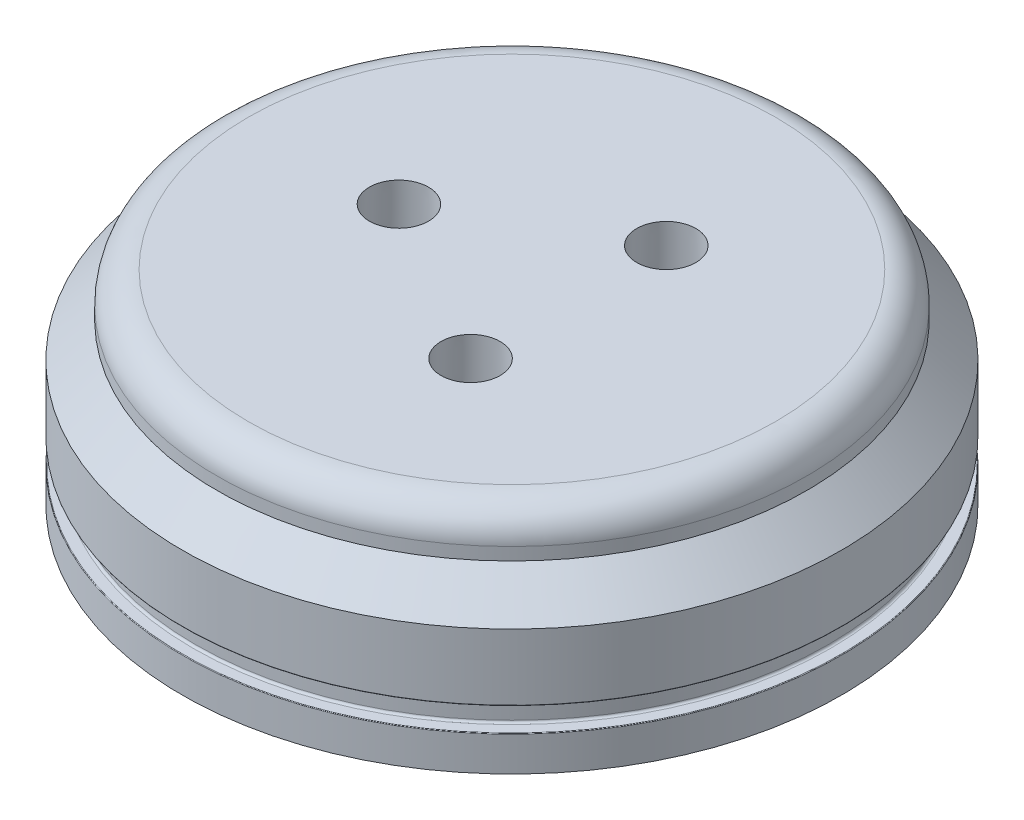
from build123d import *

# Parameters (mm, degrees)
CIRPATTERN1_COUNT              = 3
FILLET1_R                      = 6.35
F_8_32_TAPPED_HOLE1_AT_2_COUNT = 2
F_8_32_TAPPED_HOLE1_AT_2_PITCH = 12.7
CIRPATTERN3_COUNT              = 5


with BuildPart() as part:
    # Sketch1 → Revolve1 (revolve)
    with BuildSketch(Plane.XY, mode=Mode.PRIVATE) as revolve1_sk:
        with BuildLine():
            Line((-66.675, 0), (-66.675, 6.985))
            ThreePointArc((-66.675, 6.985), (-66.637802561, 7.074802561), (-66.548, 7.112))
            Line((-66.548, 7.112), (-64.4779, 7.112))
            ThreePointArc((-64.4779, 7.112), (-64.163591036, 7.242191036), (-64.0334, 7.5565))
            Line((-64.0334, 7.5565), (-64.0334, 11.4935))
            ThreePointArc((-64.0334, 11.4935), (-64.163591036, 11.807808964), (-64.4779, 11.938))
            Line((-64.4779, 11.938), (-66.548, 11.938))
            ThreePointArc((-66.548, 11.938), (-66.637802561, 11.975197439), (-66.675, 12.065))
            Line((-66.675, 12.065), (-66.675, 25.4))
            Line((-66.675, 25.4), (-59.69, 32.385))
            Line((-59.69, 32.385), (-59.69, 41.275))
            Line((-59.69, 41.275), (0, 41.275))
            Line((0, 41.275), (0, 32.385))
            Line((0, 32.385), (-50.8, 32.385))
            Line((-50.8, 32.385), (-50.8, 0))
            Line((-50.8, 0), (-66.675, 0))
        make_face()
    revolve(revolve1_sk.sketch.rotate(Axis((0, 0, 0), (0, 1, 0)), 270), axis=Axis((0, 0, 0), (0, 1, 0)))

    # Sketch2 → 1_4 NPT Tapped Hole1 (revolve, cut)
    with BuildSketch(Plane(origin=(-22.86, 32.385, 0), x_dir=(0, 0, -1), z_dir=(1, 0, 0))):
        Polygon((0, 0), (0, 8.89), (5.5626, 8.89), (5.5626, 10.033), (5.943680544, 10.033), (6.244082, 0), align=None)
    f_1_4_npt_tapped_hole1 = revolve(axis=Axis((-22.86, 26.035, 0), (0, 1, 0)), mode=Mode.SUBTRACT)

    # CirPattern1: 1_4 NPT Tapped Hole1 ×3 about axis
    cirpattern1_axis = Axis((0, 0, 0), (0, 1, 0))
    for i in range(1, CIRPATTERN1_COUNT):
        add(f_1_4_npt_tapped_hole1.rotate(cirpattern1_axis, i * 360 / CIRPATTERN1_COUNT), mode=Mode.SUBTRACT)

    # Fillet1
    fillet1_edges = [part.edges().sort_by_distance(p)[0] for p in [
        (0, 32.385, 50.8),
        (0, 41.275, 59.69),
    ]]
    fillet(fillet1_edges, radius=FILLET1_R)

    # Sketch10 → 8-32 Tapped Hole1 (revolve, cut)
    with BuildSketch(Plane(origin=(53.144542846, 0, 25.015024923), x_dir=(0, 0, -1), z_dir=(1, 0, 0))):
        Polygon((0, 0), (0, 13.331406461), (1.7272, 12.2936), (1.7272, 0), align=None)
    f_8_32_tapped_hole1 = revolve(axis=Axis((53.144542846, -6.35, 25.015024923), (0, 1, 0)), mode=Mode.SUBTRACT)

    # 8-32 Tapped Hole1 at 2: 8-32 Tapped Hole1 ×2
    with Locations(*[Vector(0.325568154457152, 0, -0.9455185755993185) * (i * F_8_32_TAPPED_HOLE1_AT_2_PITCH) for i in range(1, F_8_32_TAPPED_HOLE1_AT_2_COUNT)]):
        add(f_8_32_tapped_hole1, mode=Mode.SUBTRACT)

    # CirPattern3: 8-32 Tapped Hole1 ×5 about axis
    cirpattern3_axis = Axis((0, 0, 0), (0, 1, 0))
    for i in range(1, CIRPATTERN3_COUNT):
        add(f_8_32_tapped_hole1.rotate(cirpattern3_axis, i * 360 / CIRPATTERN3_COUNT), mode=Mode.SUBTRACT)

    # CirPattern3 copy 1 sketch → CirPattern3 copy 1 (revolve, cut)
    with BuildSketch(Plane(origin=(30.070598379, 0, -50.456446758), x_dir=(-0.9510565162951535, 0, -0.30901699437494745), z_dir=(0.30901699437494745, 0, -0.9510565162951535))):
        Polygon((0, 0), (0, 13.331406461), (1.7272, 12.2936), (1.7272, 0), align=None)
    revolve(axis=Axis((30.070598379, -6.35, -50.456446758), (0, 1, 0)), mode=Mode.SUBTRACT)

    # CirPattern3 copy 2 sketch → CirPattern3 copy 2 (revolve, cut)
    with BuildSketch(Plane(origin=(-38.694606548, 0, -44.190738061), x_dir=(-0.5877852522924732, 0, 0.8090169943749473), z_dir=(-0.8090169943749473, 0, -0.5877852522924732))):
        Polygon((0, 0), (0, 13.331406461), (1.7272, 12.2936), (1.7272, 0), align=None)
    revolve(axis=Axis((-38.694606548, -6.35, -44.190738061), (0, 1, 0)), mode=Mode.SUBTRACT)

    # CirPattern3 copy 3 sketch → CirPattern3 copy 3 (revolve, cut)
    with BuildSketch(Plane(origin=(-53.985180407, 0, 23.145068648), x_dir=(0.587785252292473, 0, 0.8090169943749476), z_dir=(-0.8090169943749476, 0, 0.587785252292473))):
        Polygon((0, 0), (0, 13.331406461), (1.7272, 12.2936), (1.7272, 0), align=None)
    revolve(axis=Axis((-53.985180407, -6.35, 23.145068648), (0, 1, 0)), mode=Mode.SUBTRACT)

    # CirPattern3 copy 4 sketch → CirPattern3 copy 4 (revolve, cut)
    with BuildSketch(Plane(origin=(5.329930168, 0, 58.495177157), x_dir=(0.9510565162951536, 0, -0.30901699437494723), z_dir=(0.30901699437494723, 0, 0.9510565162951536))):
        Polygon((0, 0), (0, 13.331406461), (1.7272, 12.2936), (1.7272, 0), align=None)
    revolve(axis=Axis((5.329930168, -6.35, 58.495177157), (0, 1, 0)), mode=Mode.SUBTRACT)


solid = part.part
